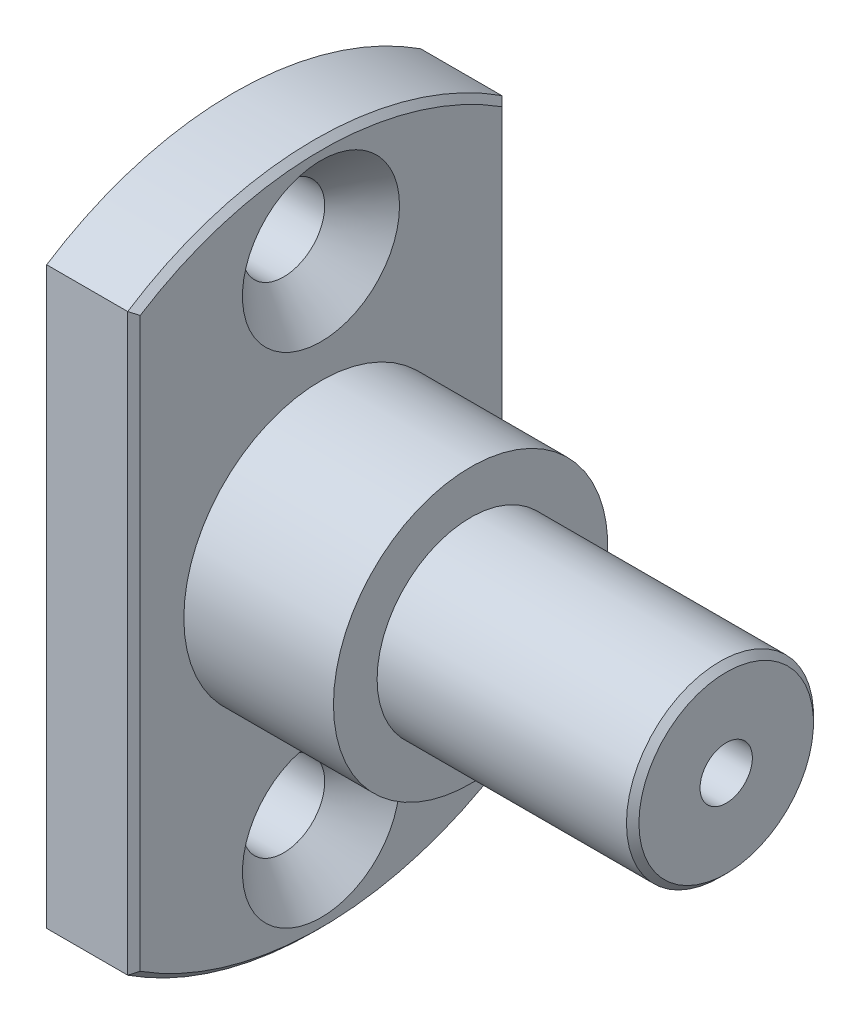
ISO-10303-21;
HEADER;
FILE_DESCRIPTION(('STEP AP214'),'2;1');
FILE_NAME('part.step','',(''),(''),'','','');
FILE_SCHEMA(('AUTOMOTIVE_DESIGN { 1 0 10303 214 1 1 1 1 }'));
ENDSEC;
DATA;
#1=APPLICATION_CONTEXT('core data for automotive mechanical design processes');
#2=APPLICATION_PROTOCOL_DEFINITION('international standard','automotive_design',2000,#1);
#3=PRODUCT_CONTEXT('',#1,'mechanical');
#4=PRODUCT('Part','Part','',(#3));
#5=PRODUCT_RELATED_PRODUCT_CATEGORY('part','',(#4));
#6=PRODUCT_DEFINITION_FORMATION('','',#4);
#7=PRODUCT_DEFINITION_CONTEXT('part definition',#1,'design');
#8=PRODUCT_DEFINITION('design','',#6,#7);
#9=PRODUCT_DEFINITION_SHAPE('','',#8);
#10=(LENGTH_UNIT() NAMED_UNIT(*) SI_UNIT(.MILLI.,.METRE.));
#11=(NAMED_UNIT(*) PLANE_ANGLE_UNIT() SI_UNIT($,.RADIAN.));
#12=(NAMED_UNIT(*) SI_UNIT($,.STERADIAN.) SOLID_ANGLE_UNIT());
#13=UNCERTAINTY_MEASURE_WITH_UNIT(LENGTH_MEASURE(1.E-05),#10,'distance_accuracy_value','');
#14=(GEOMETRIC_REPRESENTATION_CONTEXT(3) GLOBAL_UNCERTAINTY_ASSIGNED_CONTEXT((#13)) GLOBAL_UNIT_ASSIGNED_CONTEXT((#10,
#11,#12)) REPRESENTATION_CONTEXT('',''));
#15=CARTESIAN_POINT('',(0.,0.,0.));
#16=DIRECTION('',(0.,0.,1.));
#17=DIRECTION('',(1.,0.,0.));
#18=AXIS2_PLACEMENT_3D('',#15,#16,#17);
#19=CARTESIAN_POINT('',(27.099999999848,0.,0.));
#20=DIRECTION('',(1.,0.,0.));
#21=DIRECTION('',(0.,1.,0.));
#22=AXIS2_PLACEMENT_3D('',#19,#20,#21);
#23=CONICAL_SURFACE('',#22,2.09999999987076,1.04719755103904);
#24=CARTESIAN_POINT('',(25.8875644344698,0.,1.13686837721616E-10));
#25=VERTEX_POINT('',#24);
#26=VERTEX_LOOP('',#25);
#27=FACE_BOUND('',#26,.T.);
#28=CARTESIAN_POINT('',(27.1,0.,0.));
#29=DIRECTION('',(1.,0.,0.));
#30=DIRECTION('',(0.,0.,-1.));
#31=AXIS2_PLACEMENT_3D('',#28,#29,#30);
#32=CIRCLE('',#31,2.1);
#33=CARTESIAN_POINT('',(27.1,0.,-2.1));
#34=VERTEX_POINT('',#33);
#35=EDGE_CURVE('E80',#34,#34,#32,.T.);
#36=ORIENTED_EDGE('',*,*,#35,.T.);
#37=EDGE_LOOP('',(#36));
#38=FACE_BOUND('',#37,.T.);
#39=ADVANCED_FACE('F16',(#27,#38),#23,.F.);
#40=CARTESIAN_POINT('',(39.5,0.,0.));
#41=DIRECTION('',(1.,0.,0.));
#42=DIRECTION('',(0.,0.,-1.));
#43=AXIS2_PLACEMENT_3D('',#40,#41,#42);
#44=CYLINDRICAL_SURFACE('',#43,2.1);
#45=ORIENTED_EDGE('',*,*,#35,.F.);
#46=EDGE_LOOP('',(#45));
#47=FACE_BOUND('',#46,.T.);
#48=CARTESIAN_POINT('',(39.5,0.,0.));
#49=DIRECTION('',(1.,0.,0.));
#50=DIRECTION('',(0.,0.,-1.));
#51=AXIS2_PLACEMENT_3D('',#48,#49,#50);
#52=CIRCLE('',#51,2.1);
#53=CARTESIAN_POINT('',(39.5,0.,-2.1));
#54=VERTEX_POINT('',#53);
#55=EDGE_CURVE('E19',#54,#54,#52,.T.);
#56=ORIENTED_EDGE('',*,*,#55,.T.);
#57=EDGE_LOOP('',(#56));
#58=FACE_BOUND('',#57,.T.);
#59=ADVANCED_FACE('F77',(#47,#58),#44,.F.);
#60=CARTESIAN_POINT('',(39.5,7.5,0.));
#61=DIRECTION('',(-1.,0.,0.));
#62=DIRECTION('',(0.,0.,1.));
#63=AXIS2_PLACEMENT_3D('',#60,#61,#62);
#64=PLANE('',#63);
#65=ORIENTED_EDGE('',*,*,#55,.F.);
#66=EDGE_LOOP('',(#65));
#67=FACE_BOUND('',#66,.T.);
#68=CARTESIAN_POINT('',(39.5,0.,0.));
#69=DIRECTION('',(-1.,0.,0.));
#70=DIRECTION('',(0.,0.,1.));
#71=AXIS2_PLACEMENT_3D('',#68,#69,#70);
#72=CIRCLE('',#71,7.00000000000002);
#73=CARTESIAN_POINT('',(39.5,0.,7.00000000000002));
#74=VERTEX_POINT('',#73);
#75=EDGE_CURVE('E84',#74,#74,#72,.T.);
#76=ORIENTED_EDGE('',*,*,#75,.F.);
#77=EDGE_LOOP('',(#76));
#78=FACE_BOUND('',#77,.T.);
#79=ADVANCED_FACE('F179',(#67,#78),#64,.F.);
#80=CARTESIAN_POINT('',(39.,0.,0.));
#81=DIRECTION('',(-1.,0.,0.));
#82=DIRECTION('',(0.,0.,1.));
#83=AXIS2_PLACEMENT_3D('',#80,#81,#82);
#84=CONICAL_SURFACE('',#83,7.5,0.785398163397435);
#85=CARTESIAN_POINT('',(39.,0.,0.));
#86=DIRECTION('',(-1.,0.,0.));
#87=DIRECTION('',(0.,0.,1.));
#88=AXIS2_PLACEMENT_3D('',#85,#86,#87);
#89=CIRCLE('',#88,7.5);
#90=CARTESIAN_POINT('',(39.,0.,7.5));
#91=VERTEX_POINT('',#90);
#92=EDGE_CURVE('E86',#91,#91,#89,.T.);
#93=ORIENTED_EDGE('',*,*,#92,.F.);
#94=EDGE_LOOP('',(#93));
#95=FACE_BOUND('',#94,.T.);
#96=ORIENTED_EDGE('',*,*,#75,.T.);
#97=EDGE_LOOP('',(#96));
#98=FACE_BOUND('',#97,.T.);
#99=ADVANCED_FACE('F177',(#95,#98),#84,.T.);
#100=CARTESIAN_POINT('',(-33.4245148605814,0.,0.));
#101=DIRECTION('',(-1.,0.,0.));
#102=DIRECTION('',(0.,0.,1.));
#103=AXIS2_PLACEMENT_3D('',#100,#101,#102);
#104=CYLINDRICAL_SURFACE('',#103,7.5);
#105=CARTESIAN_POINT('',(19.,0.,0.));
#106=DIRECTION('',(-1.,0.,0.));
#107=DIRECTION('',(0.,0.,1.));
#108=AXIS2_PLACEMENT_3D('',#105,#106,#107);
#109=CIRCLE('',#108,7.5);
#110=CARTESIAN_POINT('',(19.,0.,7.5));
#111=VERTEX_POINT('',#110);
#112=EDGE_CURVE('E167',#111,#111,#109,.F.);
#113=ORIENTED_EDGE('',*,*,#112,.T.);
#114=EDGE_LOOP('',(#113));
#115=FACE_BOUND('',#114,.T.);
#116=ORIENTED_EDGE('',*,*,#92,.T.);
#117=EDGE_LOOP('',(#116));
#118=FACE_BOUND('',#117,.T.);
#119=ADVANCED_FACE('F175',(#115,#118),#104,.T.);
#120=CARTESIAN_POINT('',(19.,11.,0.));
#121=DIRECTION('',(-1.,0.,0.));
#122=DIRECTION('',(0.,0.,1.));
#123=AXIS2_PLACEMENT_3D('',#120,#121,#122);
#124=PLANE('',#123);
#125=ORIENTED_EDGE('',*,*,#112,.F.);
#126=EDGE_LOOP('',(#125));
#127=FACE_BOUND('',#126,.T.);
#128=CARTESIAN_POINT('',(19.,0.,0.));
#129=DIRECTION('',(-1.,0.,0.));
#130=DIRECTION('',(0.,0.,1.));
#131=AXIS2_PLACEMENT_3D('',#128,#129,#130);
#132=CIRCLE('',#131,11.);
#133=CARTESIAN_POINT('',(19.,0.,11.));
#134=VERTEX_POINT('',#133);
#135=EDGE_CURVE('E164',#134,#134,#132,.T.);
#136=ORIENTED_EDGE('',*,*,#135,.F.);
#137=EDGE_LOOP('',(#136));
#138=FACE_BOUND('',#137,.T.);
#139=ADVANCED_FACE('F186',(#127,#138),#124,.F.);
#140=CARTESIAN_POINT('',(-33.4245148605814,0.,0.));
#141=DIRECTION('',(-1.,0.,0.));
#142=DIRECTION('',(0.,0.,1.));
#143=AXIS2_PLACEMENT_3D('',#140,#141,#142);
#144=CYLINDRICAL_SURFACE('',#143,11.);
#145=CARTESIAN_POINT('',(7.,0.,0.));
#146=DIRECTION('',(-1.,0.,0.));
#147=DIRECTION('',(0.,0.,1.));
#148=AXIS2_PLACEMENT_3D('',#145,#146,#147);
#149=CIRCLE('',#148,11.);
#150=CARTESIAN_POINT('',(7.,0.,11.));
#151=VERTEX_POINT('',#150);
#152=EDGE_CURVE('E161',#151,#151,#149,.F.);
#153=ORIENTED_EDGE('',*,*,#152,.T.);
#154=EDGE_LOOP('',(#153));
#155=FACE_BOUND('',#154,.T.);
#156=ORIENTED_EDGE('',*,*,#135,.T.);
#157=EDGE_LOOP('',(#156));
#158=FACE_BOUND('',#157,.T.);
#159=ADVANCED_FACE('F285',(#155,#158),#144,.T.);
#160=CARTESIAN_POINT('',(-8.,0.,0.));
#161=DIRECTION('',(1.,0.,0.));
#162=DIRECTION('',(0.,0.,-1.));
#163=AXIS2_PLACEMENT_3D('',#160,#161,#162);
#164=PLANE('',#163);
#165=CARTESIAN_POINT('',(-7.99999999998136,0.,0.));
#166=DIRECTION('',(1.,0.,0.));
#167=DIRECTION('',(0.,1.,0.));
#168=AXIS2_PLACEMENT_3D('',#165,#166,#167);
#169=CIRCLE('',#168,4.50000000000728);
#170=CARTESIAN_POINT('',(-7.99999999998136,4.50000000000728,0.));
#171=VERTEX_POINT('',#170);
#172=EDGE_CURVE('E152',#171,#171,#169,.T.);
#173=ORIENTED_EDGE('',*,*,#172,.F.);
#174=EDGE_LOOP('',(#173));
#175=FACE_BOUND('',#174,.T.);
#176=ADVANCED_FACE('F275',(#175),#164,.F.);
#177=CARTESIAN_POINT('',(7.,27.5,0.));
#178=DIRECTION('',(-1.,0.,0.));
#179=DIRECTION('',(0.,0.,1.));
#180=AXIS2_PLACEMENT_3D('',#177,#178,#179);
#181=PLANE('',#180);
#182=ORIENTED_EDGE('',*,*,#152,.F.);
#183=EDGE_LOOP('',(#182));
#184=FACE_BOUND('',#183,.T.);
#185=CARTESIAN_POINT('',(7.000000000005,-20.,0.));
#186=DIRECTION('',(1.,0.,0.));
#187=DIRECTION('',(0.,0.,-1.));
#188=AXIS2_PLACEMENT_3D('',#185,#186,#187);
#189=CIRCLE('',#188,6.29999999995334);
#190=CARTESIAN_POINT('',(7.000000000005,-20.,-6.29999999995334));
#191=VERTEX_POINT('',#190);
#192=EDGE_CURVE('E155',#191,#191,#189,.F.);
#193=ORIENTED_EDGE('',*,*,#192,.T.);
#194=EDGE_LOOP('',(#193));
#195=FACE_BOUND('',#194,.T.);
#196=CARTESIAN_POINT('',(7.000000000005,20.,0.));
#197=DIRECTION('',(1.,0.,0.));
#198=DIRECTION('',(0.,0.,-1.));
#199=AXIS2_PLACEMENT_3D('',#196,#197,#198);
#200=CIRCLE('',#199,6.29999999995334);
#201=CARTESIAN_POINT('',(7.000000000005,20.,-6.29999999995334));
#202=VERTEX_POINT('',#201);
#203=EDGE_CURVE('E158',#202,#202,#200,.F.);
#204=ORIENTED_EDGE('',*,*,#203,.T.);
#205=EDGE_LOOP('',(#204));
#206=FACE_BOUND('',#205,.T.);
#207=DIRECTION('',(0.,1.,0.));
#208=VECTOR('',#207,1.);
#209=CARTESIAN_POINT('',(7.,36.0515602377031,14.5));
#210=LINE('',#209,#208);
#211=CARTESIAN_POINT('',(7.,22.7760839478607,14.5));
#212=VERTEX_POINT('',#211);
#213=CARTESIAN_POINT('',(7.,-22.7760839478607,14.5));
#214=VERTEX_POINT('',#213);
#215=EDGE_CURVE('E143',#212,#214,#210,.F.);
#216=ORIENTED_EDGE('',*,*,#215,.T.);
#217=CARTESIAN_POINT('',(7.,0.,0.));
#218=DIRECTION('',(-1.,0.,0.));
#219=DIRECTION('',(0.,-1.,0.));
#220=AXIS2_PLACEMENT_3D('',#217,#218,#219);
#221=CIRCLE('',#220,27.);
#222=CARTESIAN_POINT('',(7.,-22.7760839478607,-14.5));
#223=VERTEX_POINT('',#222);
#224=EDGE_CURVE('E145',#223,#214,#221,.T.);
#225=ORIENTED_EDGE('',*,*,#224,.F.);
#226=DIRECTION('',(0.,1.,0.));
#227=VECTOR('',#226,1.);
#228=CARTESIAN_POINT('',(7.,36.0515602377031,-14.5));
#229=LINE('',#228,#227);
#230=CARTESIAN_POINT('',(7.,22.7760839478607,-14.5));
#231=VERTEX_POINT('',#230);
#232=EDGE_CURVE('E151',#223,#231,#229,.T.);
#233=ORIENTED_EDGE('',*,*,#232,.T.);
#234=CARTESIAN_POINT('',(7.,0.,0.));
#235=DIRECTION('',(-1.,0.,0.));
#236=DIRECTION('',(0.,0.,1.));
#237=AXIS2_PLACEMENT_3D('',#234,#235,#236);
#238=CIRCLE('',#237,27.);
#239=EDGE_CURVE('E69',#212,#231,#238,.T.);
#240=ORIENTED_EDGE('',*,*,#239,.F.);
#241=EDGE_LOOP('',(#216,#225,#233,#240));
#242=FACE_BOUND('',#241,.T.);
#243=ADVANCED_FACE('F272',(#184,#195,#206,#242),#181,.F.);
#244=CARTESIAN_POINT('',(7.000000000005,20.,0.));
#245=DIRECTION('',(1.,0.,0.));
#246=DIRECTION('',(0.,0.,-1.));
#247=AXIS2_PLACEMENT_3D('',#244,#245,#246);
#248=CONICAL_SURFACE('',#247,6.29999999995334,0.785398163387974);
#249=CARTESIAN_POINT('',(4.,20.,0.));
#250=DIRECTION('',(1.,0.,0.));
#251=DIRECTION('',(0.,0.,-1.));
#252=AXIS2_PLACEMENT_3D('',#249,#250,#251);
#253=CIRCLE('',#252,3.3);
#254=CARTESIAN_POINT('',(4.,20.,-3.3));
#255=VERTEX_POINT('',#254);
#256=EDGE_CURVE('E111',#255,#255,#253,.F.);
#257=ORIENTED_EDGE('',*,*,#256,.T.);
#258=EDGE_LOOP('',(#257));
#259=FACE_BOUND('',#258,.T.);
#260=ORIENTED_EDGE('',*,*,#203,.F.);
#261=EDGE_LOOP('',(#260));
#262=FACE_BOUND('',#261,.T.);
#263=ADVANCED_FACE('F274',(#259,#262),#248,.F.);
#264=CARTESIAN_POINT('',(7.000000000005,-20.,0.));
#265=DIRECTION('',(1.,0.,0.));
#266=DIRECTION('',(0.,0.,-1.));
#267=AXIS2_PLACEMENT_3D('',#264,#265,#266);
#268=CONICAL_SURFACE('',#267,6.29999999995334,0.785398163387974);
#269=CARTESIAN_POINT('',(4.,-20.,0.));
#270=DIRECTION('',(1.,0.,0.));
#271=DIRECTION('',(0.,0.,-1.));
#272=AXIS2_PLACEMENT_3D('',#269,#270,#271);
#273=CIRCLE('',#272,3.3);
#274=CARTESIAN_POINT('',(4.,-20.,-3.3));
#275=VERTEX_POINT('',#274);
#276=EDGE_CURVE('E229',#275,#275,#273,.F.);
#277=ORIENTED_EDGE('',*,*,#276,.T.);
#278=EDGE_LOOP('',(#277));
#279=FACE_BOUND('',#278,.T.);
#280=ORIENTED_EDGE('',*,*,#192,.F.);
#281=EDGE_LOOP('',(#280));
#282=FACE_BOUND('',#281,.T.);
#283=ADVANCED_FACE('F282',(#279,#282),#268,.F.);
#284=CARTESIAN_POINT('',(-7.50000000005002,0.,0.));
#285=DIRECTION('',(1.,0.,0.));
#286=DIRECTION('',(0.,1.,0.));
#287=AXIS2_PLACEMENT_3D('',#284,#285,#286);
#288=CONICAL_SURFACE('',#287,4.99999999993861,0.785398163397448);
#289=CARTESIAN_POINT('',(-7.5,0.,0.));
#290=DIRECTION('',(-1.,0.,0.));
#291=DIRECTION('',(0.,0.,1.));
#292=AXIS2_PLACEMENT_3D('',#289,#290,#291);
#293=CIRCLE('',#292,5.);
#294=CARTESIAN_POINT('',(-7.5,0.,5.));
#295=VERTEX_POINT('',#294);
#296=EDGE_CURVE('E231',#295,#295,#293,.F.);
#297=ORIENTED_EDGE('',*,*,#296,.F.);
#298=EDGE_LOOP('',(#297));
#299=FACE_BOUND('',#298,.T.);
#300=ORIENTED_EDGE('',*,*,#172,.T.);
#301=EDGE_LOOP('',(#300));
#302=FACE_BOUND('',#301,.T.);
#303=ADVANCED_FACE('F337',(#299,#302),#288,.T.);
#304=CARTESIAN_POINT('',(6.49999999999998,36.0515602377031,-15.));
#305=DIRECTION('',(-0.707106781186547,0.,0.707106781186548));
#306=DIRECTION('',(0.707106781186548,0.,0.707106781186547));
#307=AXIS2_PLACEMENT_3D('',#304,#305,#306);
#308=PLANE('',#307);
#309=ORIENTED_EDGE('',*,*,#232,.F.);
#310=CARTESIAN_POINT('',(6.49999999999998,-23.0488611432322,-15.));
#311=CARTESIAN_POINT('',(6.58339758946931,-23.0036338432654,-14.9166024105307));
#312=CARTESIAN_POINT('',(6.66676305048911,-22.9582887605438,-14.8332369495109));
#313=CARTESIAN_POINT('',(6.83342971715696,-22.8673630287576,-14.666570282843));
#314=CARTESIAN_POINT('',(6.91673092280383,-22.8217823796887,-14.5832690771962));
#315=CARTESIAN_POINT('',(7.,-22.7760839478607,-14.5));
#316=B_SPLINE_CURVE_WITH_KNOTS('',3,(#310,#311,#312,#313,#314,#315),.UNSPECIFIED.,.F.,.F.,(4,2,
4),(0.,0.37894853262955,0.757897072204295),.UNSPECIFIED.);
#317=CARTESIAN_POINT('',(6.49999999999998,-23.0488611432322,-15.));
#318=VERTEX_POINT('',#317);
#319=EDGE_CURVE('E103',#318,#223,#316,.T.);
#320=ORIENTED_EDGE('',*,*,#319,.F.);
#321=DIRECTION('',(0.,-1.,0.));
#322=VECTOR('',#321,1.);
#323=CARTESIAN_POINT('',(6.49999999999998,36.0515602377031,-15.));
#324=LINE('',#323,#322);
#325=CARTESIAN_POINT('',(6.49999999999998,23.0488611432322,-15.));
#326=VERTEX_POINT('',#325);
#327=EDGE_CURVE('E234',#318,#326,#324,.F.);
#328=ORIENTED_EDGE('',*,*,#327,.T.);
#329=CARTESIAN_POINT('',(7.,22.7760839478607,-14.5));
#330=CARTESIAN_POINT('',(6.91673092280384,22.8217823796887,-14.5832690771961));
#331=CARTESIAN_POINT('',(6.83342971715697,22.8673630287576,-14.666570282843));
#332=CARTESIAN_POINT('',(6.66676305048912,22.9582887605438,-14.8332369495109));
#333=CARTESIAN_POINT('',(6.58339758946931,23.0036338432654,-14.9166024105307));
#334=CARTESIAN_POINT('',(6.49999999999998,23.0488611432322,-15.));
#335=B_SPLINE_CURVE_WITH_KNOTS('',3,(#329,#330,#331,#332,#333,#334),.UNSPECIFIED.,.F.,.F.,(4,2,
4),(0.,0.378948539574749,0.757897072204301),.UNSPECIFIED.);
#336=EDGE_CURVE('E144',#231,#326,#335,.T.);
#337=ORIENTED_EDGE('',*,*,#336,.F.);
#338=EDGE_LOOP('',(#309,#320,#328,#337));
#339=FACE_BOUND('',#338,.T.);
#340=ADVANCED_FACE('F118',(#339),#308,.F.);
#341=CARTESIAN_POINT('',(6.49999999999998,0.,0.));
#342=DIRECTION('',(-1.,0.,0.));
#343=DIRECTION('',(0.,0.,1.));
#344=AXIS2_PLACEMENT_3D('',#341,#342,#343);
#345=CONICAL_SURFACE('',#344,27.5,0.785398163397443);
#346=ORIENTED_EDGE('',*,*,#239,.T.);
#347=ORIENTED_EDGE('',*,*,#336,.T.);
#348=CARTESIAN_POINT('',(6.49999999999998,0.,0.));
#349=DIRECTION('',(-1.,0.,0.));
#350=DIRECTION('',(0.,0.,1.));
#351=AXIS2_PLACEMENT_3D('',#348,#349,#350);
#352=CIRCLE('',#351,27.5);
#353=CARTESIAN_POINT('',(6.49999999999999,23.0488611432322,15.));
#354=VERTEX_POINT('',#353);
#355=EDGE_CURVE('E263',#354,#326,#352,.T.);
#356=ORIENTED_EDGE('',*,*,#355,.F.);
#357=CARTESIAN_POINT('',(6.49999999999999,23.0488611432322,15.));
#358=CARTESIAN_POINT('',(6.58339758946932,23.0036338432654,14.9166024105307));
#359=CARTESIAN_POINT('',(6.66676305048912,22.9582887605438,14.8332369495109));
#360=CARTESIAN_POINT('',(6.83342971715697,22.8673630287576,14.666570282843));
#361=CARTESIAN_POINT('',(6.91673092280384,22.8217823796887,14.5832690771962));
#362=CARTESIAN_POINT('',(7.,22.7760839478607,14.5));
#363=B_SPLINE_CURVE_WITH_KNOTS('',3,(#357,#358,#359,#360,#361,#362),.UNSPECIFIED.,.F.,.F.,(4,2,
4),(0.,0.378948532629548,0.757897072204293),.UNSPECIFIED.);
#364=EDGE_CURVE('E138',#354,#212,#363,.T.);
#365=ORIENTED_EDGE('',*,*,#364,.T.);
#366=EDGE_LOOP('',(#346,#347,#356,#365));
#367=FACE_BOUND('',#366,.T.);
#368=ADVANCED_FACE('F133',(#367),#345,.T.);
#369=CARTESIAN_POINT('',(6.49999999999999,36.0515602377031,15.));
#370=DIRECTION('',(-0.707106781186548,0.,-0.707106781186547));
#371=DIRECTION('',(-0.707106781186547,0.,0.707106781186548));
#372=AXIS2_PLACEMENT_3D('',#369,#370,#371);
#373=PLANE('',#372);
#374=ORIENTED_EDGE('',*,*,#215,.F.);
#375=ORIENTED_EDGE('',*,*,#364,.F.);
#376=DIRECTION('',(0.,1.,0.));
#377=VECTOR('',#376,1.);
#378=CARTESIAN_POINT('',(6.49999999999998,36.0515602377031,15.));
#379=LINE('',#378,#377);
#380=CARTESIAN_POINT('',(6.49999999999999,-23.0488611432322,15.));
#381=VERTEX_POINT('',#380);
#382=EDGE_CURVE('E247',#354,#381,#379,.F.);
#383=ORIENTED_EDGE('',*,*,#382,.T.);
#384=CARTESIAN_POINT('',(7.,-22.7760839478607,14.5));
#385=CARTESIAN_POINT('',(6.91673092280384,-22.8217823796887,14.5832690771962));
#386=CARTESIAN_POINT('',(6.83342971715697,-22.8673630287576,14.666570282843));
#387=CARTESIAN_POINT('',(6.66676305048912,-22.9582887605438,14.8332369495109));
#388=CARTESIAN_POINT('',(6.58339758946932,-23.0036338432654,14.9166024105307));
#389=CARTESIAN_POINT('',(6.49999999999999,-23.0488611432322,15.));
#390=B_SPLINE_CURVE_WITH_KNOTS('',3,(#384,#385,#386,#387,#388,#389),.UNSPECIFIED.,.F.,.F.,(4,2,
4),(0.,0.378948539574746,0.757897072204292),.UNSPECIFIED.);
#391=EDGE_CURVE('E112',#214,#381,#390,.T.);
#392=ORIENTED_EDGE('',*,*,#391,.F.);
#393=EDGE_LOOP('',(#374,#375,#383,#392));
#394=FACE_BOUND('',#393,.T.);
#395=ADVANCED_FACE('F127',(#394),#373,.F.);
#396=CARTESIAN_POINT('',(6.49999999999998,0.,0.));
#397=DIRECTION('',(-1.,0.,0.));
#398=DIRECTION('',(0.,-1.,0.));
#399=AXIS2_PLACEMENT_3D('',#396,#397,#398);
#400=CONICAL_SURFACE('',#399,27.5,0.785398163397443);
#401=CARTESIAN_POINT('',(6.49999999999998,0.,0.));
#402=DIRECTION('',(-1.,0.,0.));
#403=DIRECTION('',(0.,0.,1.));
#404=AXIS2_PLACEMENT_3D('',#401,#402,#403);
#405=CIRCLE('',#404,27.5);
#406=EDGE_CURVE('E243',#318,#381,#405,.T.);
#407=ORIENTED_EDGE('',*,*,#406,.F.);
#408=ORIENTED_EDGE('',*,*,#319,.T.);
#409=ORIENTED_EDGE('',*,*,#224,.T.);
#410=ORIENTED_EDGE('',*,*,#391,.T.);
#411=EDGE_LOOP('',(#407,#408,#409,#410));
#412=FACE_BOUND('',#411,.T.);
#413=ADVANCED_FACE('F122',(#412),#400,.T.);
#414=CARTESIAN_POINT('',(7.,20.,0.));
#415=DIRECTION('',(1.,0.,0.));
#416=DIRECTION('',(0.,0.,-1.));
#417=AXIS2_PLACEMENT_3D('',#414,#415,#416);
#418=CYLINDRICAL_SURFACE('',#417,3.3);
#419=CARTESIAN_POINT('',(0.,20.,0.));
#420=DIRECTION('',(1.,0.,0.));
#421=DIRECTION('',(0.,0.,-1.));
#422=AXIS2_PLACEMENT_3D('',#419,#420,#421);
#423=CIRCLE('',#422,3.3);
#424=CARTESIAN_POINT('',(0.,20.,-3.3));
#425=VERTEX_POINT('',#424);
#426=EDGE_CURVE('E99',#425,#425,#423,.F.);
#427=ORIENTED_EDGE('',*,*,#426,.T.);
#428=EDGE_LOOP('',(#427));
#429=FACE_BOUND('',#428,.T.);
#430=ORIENTED_EDGE('',*,*,#256,.F.);
#431=EDGE_LOOP('',(#430));
#432=FACE_BOUND('',#431,.T.);
#433=ADVANCED_FACE('F126',(#429,#432),#418,.F.);
#434=CARTESIAN_POINT('',(7.,-20.,0.));
#435=DIRECTION('',(1.,0.,0.));
#436=DIRECTION('',(0.,0.,-1.));
#437=AXIS2_PLACEMENT_3D('',#434,#435,#436);
#438=CYLINDRICAL_SURFACE('',#437,3.3);
#439=CARTESIAN_POINT('',(0.,-20.,0.));
#440=DIRECTION('',(1.,0.,0.));
#441=DIRECTION('',(0.,0.,-1.));
#442=AXIS2_PLACEMENT_3D('',#439,#440,#441);
#443=CIRCLE('',#442,3.3);
#444=CARTESIAN_POINT('',(0.,-20.,-3.3));
#445=VERTEX_POINT('',#444);
#446=EDGE_CURVE('E96',#445,#445,#443,.F.);
#447=ORIENTED_EDGE('',*,*,#446,.T.);
#448=EDGE_LOOP('',(#447));
#449=FACE_BOUND('',#448,.T.);
#450=ORIENTED_EDGE('',*,*,#276,.F.);
#451=EDGE_LOOP('',(#450));
#452=FACE_BOUND('',#451,.T.);
#453=ADVANCED_FACE('F217',(#449,#452),#438,.F.);
#454=CARTESIAN_POINT('',(-33.4245148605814,0.,0.));
#455=DIRECTION('',(-1.,0.,0.));
#456=DIRECTION('',(0.,0.,1.));
#457=AXIS2_PLACEMENT_3D('',#454,#455,#456);
#458=CYLINDRICAL_SURFACE('',#457,5.);
#459=ORIENTED_EDGE('',*,*,#296,.T.);
#460=EDGE_LOOP('',(#459));
#461=FACE_BOUND('',#460,.T.);
#462=CARTESIAN_POINT('',(0.,0.,0.));
#463=DIRECTION('',(-1.,0.,0.));
#464=DIRECTION('',(0.,0.,1.));
#465=AXIS2_PLACEMENT_3D('',#462,#463,#464);
#466=CIRCLE('',#465,5.);
#467=CARTESIAN_POINT('',(0.,0.,5.));
#468=VERTEX_POINT('',#467);
#469=EDGE_CURVE('E93',#468,#468,#466,.T.);
#470=ORIENTED_EDGE('',*,*,#469,.T.);
#471=EDGE_LOOP('',(#470));
#472=FACE_BOUND('',#471,.T.);
#473=ADVANCED_FACE('F214',(#461,#472),#458,.T.);
#474=CARTESIAN_POINT('',(-8.,36.0515602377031,-15.));
#475=DIRECTION('',(0.,0.,1.));
#476=DIRECTION('',(0.,-1.,0.));
#477=AXIS2_PLACEMENT_3D('',#474,#475,#476);
#478=PLANE('',#477);
#479=ORIENTED_EDGE('',*,*,#327,.F.);
#480=DIRECTION('',(-1.,0.,0.));
#481=VECTOR('',#480,1.);
#482=CARTESIAN_POINT('',(-33.4245148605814,-23.0488611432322,-15.));
#483=LINE('',#482,#481);
#484=CARTESIAN_POINT('',(0.,-23.0488611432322,-15.));
#485=VERTEX_POINT('',#484);
#486=EDGE_CURVE('E102',#485,#318,#483,.F.);
#487=ORIENTED_EDGE('',*,*,#486,.F.);
#488=DIRECTION('',(0.,1.,0.));
#489=VECTOR('',#488,1.);
#490=CARTESIAN_POINT('',(0.,5.,-15.));
#491=LINE('',#490,#489);
#492=CARTESIAN_POINT('',(0.,23.0488611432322,-15.));
#493=VERTEX_POINT('',#492);
#494=EDGE_CURVE('E92',#485,#493,#491,.T.);
#495=ORIENTED_EDGE('',*,*,#494,.T.);
#496=DIRECTION('',(-1.,0.,0.));
#497=VECTOR('',#496,1.);
#498=CARTESIAN_POINT('',(-33.4245148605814,23.0488611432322,-15.));
#499=LINE('',#498,#497);
#500=EDGE_CURVE('E261',#326,#493,#499,.T.);
#501=ORIENTED_EDGE('',*,*,#500,.F.);
#502=EDGE_LOOP('',(#479,#487,#495,#501));
#503=FACE_BOUND('',#502,.T.);
#504=ADVANCED_FACE('F210',(#503),#478,.F.);
#505=CARTESIAN_POINT('',(-33.4245148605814,0.,0.));
#506=DIRECTION('',(-1.,0.,0.));
#507=DIRECTION('',(0.,0.,1.));
#508=AXIS2_PLACEMENT_3D('',#505,#506,#507);
#509=CYLINDRICAL_SURFACE('',#508,27.5);
#510=ORIENTED_EDGE('',*,*,#355,.T.);
#511=ORIENTED_EDGE('',*,*,#500,.T.);
#512=CARTESIAN_POINT('',(0.,0.,0.));
#513=DIRECTION('',(-1.,0.,0.));
#514=DIRECTION('',(0.,0.,1.));
#515=AXIS2_PLACEMENT_3D('',#512,#513,#514);
#516=CIRCLE('',#515,27.5);
#517=CARTESIAN_POINT('',(0.,23.0488611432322,15.));
#518=VERTEX_POINT('',#517);
#519=EDGE_CURVE('E89',#493,#518,#516,.F.);
#520=ORIENTED_EDGE('',*,*,#519,.T.);
#521=DIRECTION('',(1.,0.,0.));
#522=VECTOR('',#521,1.);
#523=CARTESIAN_POINT('',(-8.,23.0488611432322,15.));
#524=LINE('',#523,#522);
#525=EDGE_CURVE('E252',#518,#354,#524,.T.);
#526=ORIENTED_EDGE('',*,*,#525,.T.);
#527=EDGE_LOOP('',(#510,#511,#520,#526));
#528=FACE_BOUND('',#527,.T.);
#529=ADVANCED_FACE('F206',(#528),#509,.T.);
#530=CARTESIAN_POINT('',(-8.,36.0515602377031,15.));
#531=DIRECTION('',(0.,0.,-1.));
#532=DIRECTION('',(0.,1.,0.));
#533=AXIS2_PLACEMENT_3D('',#530,#531,#532);
#534=PLANE('',#533);
#535=ORIENTED_EDGE('',*,*,#382,.F.);
#536=ORIENTED_EDGE('',*,*,#525,.F.);
#537=DIRECTION('',(0.,1.,0.));
#538=VECTOR('',#537,1.);
#539=CARTESIAN_POINT('',(0.,5.,15.));
#540=LINE('',#539,#538);
#541=CARTESIAN_POINT('',(0.,-23.0488611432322,15.));
#542=VERTEX_POINT('',#541);
#543=EDGE_CURVE('E25',#518,#542,#540,.F.);
#544=ORIENTED_EDGE('',*,*,#543,.T.);
#545=DIRECTION('',(-1.,0.,0.));
#546=VECTOR('',#545,1.);
#547=CARTESIAN_POINT('',(-33.4245148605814,-23.0488611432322,15.));
#548=LINE('',#547,#546);
#549=EDGE_CURVE('E33',#381,#542,#548,.T.);
#550=ORIENTED_EDGE('',*,*,#549,.F.);
#551=EDGE_LOOP('',(#535,#536,#544,#550));
#552=FACE_BOUND('',#551,.T.);
#553=ADVANCED_FACE('F199',(#552),#534,.F.);
#554=CARTESIAN_POINT('',(-33.4245148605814,0.,0.));
#555=DIRECTION('',(-1.,0.,0.));
#556=DIRECTION('',(0.,0.,1.));
#557=AXIS2_PLACEMENT_3D('',#554,#555,#556);
#558=CYLINDRICAL_SURFACE('',#557,27.5);
#559=CARTESIAN_POINT('',(0.,0.,0.));
#560=DIRECTION('',(-1.,0.,0.));
#561=DIRECTION('',(0.,0.,1.));
#562=AXIS2_PLACEMENT_3D('',#559,#560,#561);
#563=CIRCLE('',#562,27.5);
#564=EDGE_CURVE('E11',#542,#485,#563,.F.);
#565=ORIENTED_EDGE('',*,*,#564,.T.);
#566=ORIENTED_EDGE('',*,*,#486,.T.);
#567=ORIENTED_EDGE('',*,*,#406,.T.);
#568=ORIENTED_EDGE('',*,*,#549,.T.);
#569=EDGE_LOOP('',(#565,#566,#567,#568));
#570=FACE_BOUND('',#569,.T.);
#571=ADVANCED_FACE('F193',(#570),#558,.T.);
#572=CARTESIAN_POINT('',(0.,5.,0.));
#573=DIRECTION('',(1.,0.,0.));
#574=DIRECTION('',(0.,0.,-1.));
#575=AXIS2_PLACEMENT_3D('',#572,#573,#574);
#576=PLANE('',#575);
#577=ORIENTED_EDGE('',*,*,#543,.F.);
#578=ORIENTED_EDGE('',*,*,#519,.F.);
#579=ORIENTED_EDGE('',*,*,#494,.F.);
#580=ORIENTED_EDGE('',*,*,#564,.F.);
#581=EDGE_LOOP('',(#577,#578,#579,#580));
#582=FACE_BOUND('',#581,.T.);
#583=ORIENTED_EDGE('',*,*,#469,.F.);
#584=EDGE_LOOP('',(#583));
#585=FACE_BOUND('',#584,.T.);
#586=ORIENTED_EDGE('',*,*,#446,.F.);
#587=EDGE_LOOP('',(#586));
#588=FACE_BOUND('',#587,.T.);
#589=ORIENTED_EDGE('',*,*,#426,.F.);
#590=EDGE_LOOP('',(#589));
#591=FACE_BOUND('',#590,.T.);
#592=ADVANCED_FACE('F191',(#582,#585,#588,#591),#576,.F.);
#593=CLOSED_SHELL('',(#39,#59,#79,#99,#119,#139,#159,#176,#243,#263,#283,#303,#340,#368,#395,
#413,#433,#453,#473,#504,#529,#553,#571,#592));
#594=MANIFOLD_SOLID_BREP('B1',#593);
#595=ADVANCED_BREP_SHAPE_REPRESENTATION('',(#18,#594),#14);
#596=SHAPE_DEFINITION_REPRESENTATION(#9,#595);
ENDSEC;
END-ISO-10303-21;
